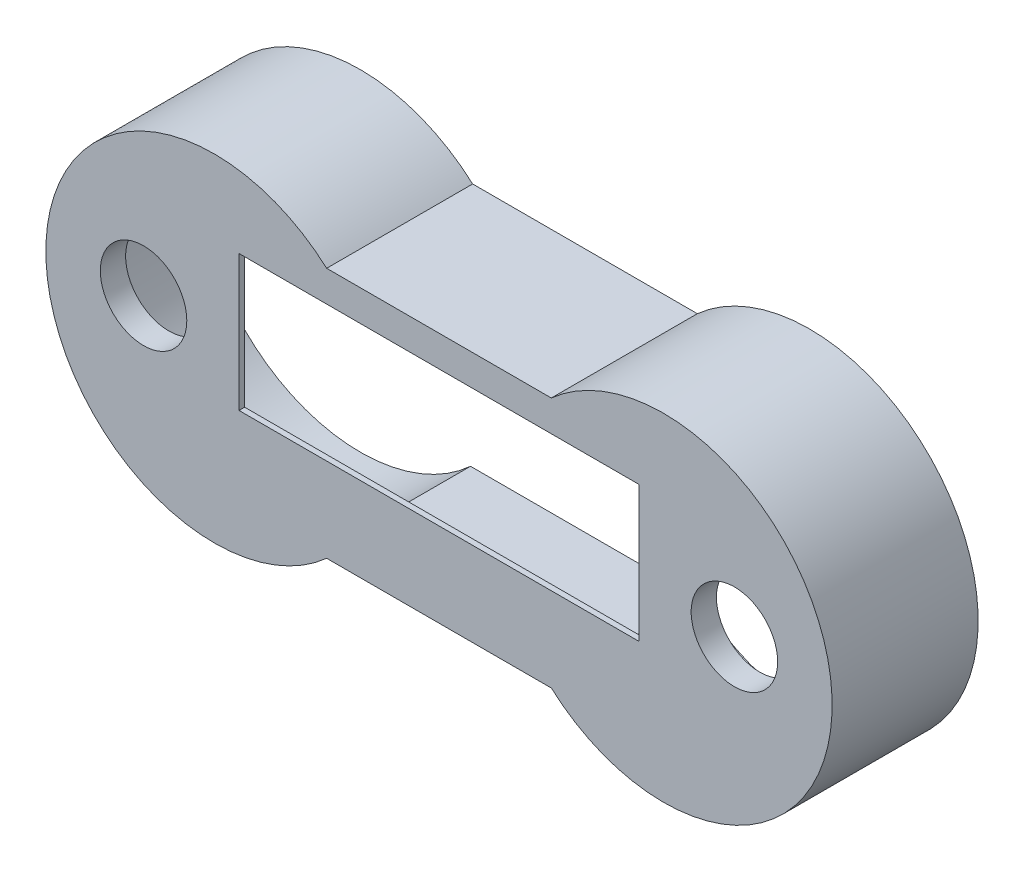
from build123d import *

# Parameters (mm, degrees)
BOSS_EXTRU_1_DEPTH      = 25
BOSS_EXTRU_2_DEPTH      = 1
ESQUISSE4_R             = 7.7
ESQUISSE4_W             = 71.2
ESQUISSE4_H             = 24.2
ENL_V_MAT_EXTRU_1_DEPTH = 155.464562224
ESQUISSE5_R             = 8.7
ESQUISSE5_R_2           = 7.7
BOSS_EXTRU_4_DEPTH      = 3.5


with BuildPart() as part:
    # Esquisse2 → Boss.-Extru.1 (new body)
    with BuildSketch(Plane.XY):
        with BuildLine():
            Line((50, 7.5), (90, 7.5))
            ThreePointArc((90, 7.5), (140, 29.860679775), (90, 52.22135955))
            Line((90, 52.22135955), (50, 52.22135955))
            ThreePointArc((50, 52.22135955), (0, 29.860679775), (50, 7.5))
        make_face()
        with BuildLine():
            Line((49.614315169, 8.5), (90.385684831, 8.5))
            ThreePointArc((90.385684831, 8.5), (139, 29.860679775), (90.385684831, 51.22135955))
            Line((90.385684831, 51.22135955), (49.614315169, 51.22135955))
            ThreePointArc((49.614315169, 51.22135955), (1, 29.860679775), (49.614315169, 8.5))
        make_face(mode=Mode.SUBTRACT)
    extrude(amount=BOSS_EXTRU_1_DEPTH)

    # Esquisse3 → Boss.-Extru.2 (add)
    with BuildSketch(Plane.XY.offset(25)):
        with BuildLine():
            Line((90, 52.22135955), (50, 52.22135955))
            ThreePointArc((50, 52.22135955), (0, 29.860679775), (50, 7.5))
            Line((50, 7.5), (90, 7.5))
            ThreePointArc((90, 7.5), (140, 29.860679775), (90, 52.22135955))
        make_face()
    extrude(amount=BOSS_EXTRU_2_DEPTH)

    # Esquisse4 → Enl_v. mat.-Extru.1 (cut, through all)
    with BuildSketch(Plane.XY.offset(26)):
        with Locations((17.4, 31.7)):
            Circle(ESQUISSE4_R)
        with Locations((122.6, 31.7)):
            Circle(ESQUISSE4_R)
        with Locations((70, 34.6)):
            Rectangle(ESQUISSE4_W, ESQUISSE4_H)
    extrude(amount=-ENL_V_MAT_EXTRU_1_DEPTH, mode=Mode.SUBTRACT)

    # Esquisse5 → Boss.-Extru.4 (add)
    # profile 1 of 2: a face of its own
    with BuildSketch(Plane(origin=(0, 0, 25), x_dir=(-1, 0, 0), z_dir=(0, 0, -1))):
        with Locations(Location((-122.6, 31.7, 0), (0, 0, 180))):
            Circle(ESQUISSE5_R)
        with Locations(Location((-122.6, 31.7, 0), (0, 0, 180))):
            Circle(ESQUISSE5_R_2, mode=Mode.SUBTRACT)
    # profile 2 of 2: a face of its own
    with BuildSketch(Plane(origin=(0, 0, 25), x_dir=(-1, 0, 0), z_dir=(0, 0, -1))):
        with Locations(Location((-17.4, 31.7, 0), (0, 0, 180))):
            Circle(ESQUISSE5_R)
        with Locations(Location((-17.4, 31.7, 0), (0, 0, 180))):
            Circle(ESQUISSE5_R_2, mode=Mode.SUBTRACT)
    extrude(amount=BOSS_EXTRU_4_DEPTH)


solid = part.part
